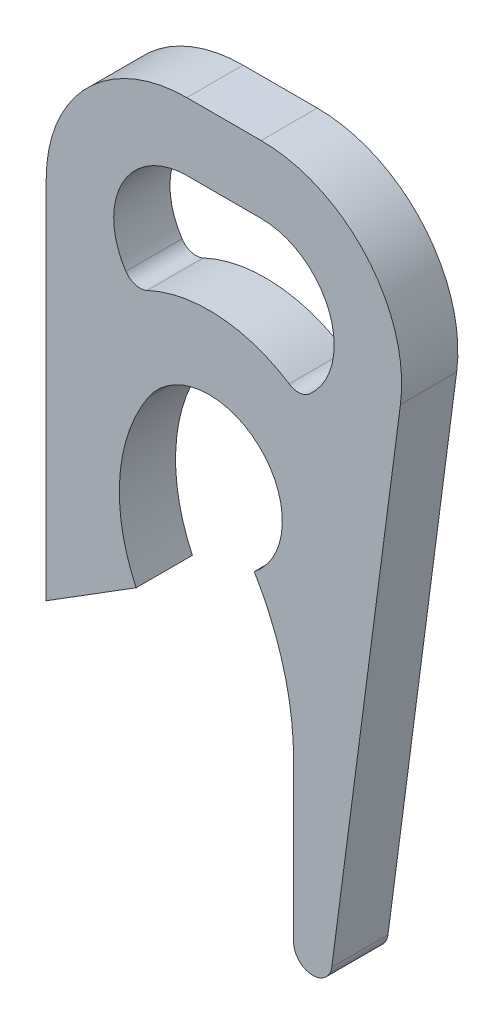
ISO-10303-21;
HEADER;
FILE_DESCRIPTION(('STEP AP214'),'2;1');
FILE_NAME('part.step','',(''),(''),'','','');
FILE_SCHEMA(('AUTOMOTIVE_DESIGN { 1 0 10303 214 1 1 1 1 }'));
ENDSEC;
DATA;
#1=APPLICATION_CONTEXT('core data for automotive mechanical design processes');
#2=APPLICATION_PROTOCOL_DEFINITION('international standard','automotive_design',2000,#1);
#3=PRODUCT_CONTEXT('',#1,'mechanical');
#4=PRODUCT('Part','Part','',(#3));
#5=PRODUCT_RELATED_PRODUCT_CATEGORY('part','',(#4));
#6=PRODUCT_DEFINITION_FORMATION('','',#4);
#7=PRODUCT_DEFINITION_CONTEXT('part definition',#1,'design');
#8=PRODUCT_DEFINITION('design','',#6,#7);
#9=PRODUCT_DEFINITION_SHAPE('','',#8);
#10=(LENGTH_UNIT() NAMED_UNIT(*) SI_UNIT(.MILLI.,.METRE.));
#11=(NAMED_UNIT(*) PLANE_ANGLE_UNIT() SI_UNIT($,.RADIAN.));
#12=(NAMED_UNIT(*) SI_UNIT($,.STERADIAN.) SOLID_ANGLE_UNIT());
#13=UNCERTAINTY_MEASURE_WITH_UNIT(LENGTH_MEASURE(1.E-05),#10,'distance_accuracy_value','');
#14=(GEOMETRIC_REPRESENTATION_CONTEXT(3) GLOBAL_UNCERTAINTY_ASSIGNED_CONTEXT((#13)) GLOBAL_UNIT_ASSIGNED_CONTEXT((#10,
#11,#12)) REPRESENTATION_CONTEXT('',''));
#15=CARTESIAN_POINT('',(0.,0.,0.));
#16=DIRECTION('',(0.,0.,1.));
#17=DIRECTION('',(1.,0.,0.));
#18=AXIS2_PLACEMENT_3D('',#15,#16,#17);
#19=CARTESIAN_POINT('',(8.,5.,5.));
#20=DIRECTION('',(-0.52999894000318,0.847998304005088,0.));
#21=DIRECTION('',(-0.847998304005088,-0.52999894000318,0.));
#22=AXIS2_PLACEMENT_3D('',#19,#20,#21);
#23=PLANE('',#22);
#24=DIRECTION('',(0.847998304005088,0.52999894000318,0.));
#25=VECTOR('',#24,1.);
#26=CARTESIAN_POINT('',(8.,5.,0.));
#27=LINE('',#26,#25);
#28=CARTESIAN_POINT('',(0.,0.,0.));
#29=VERTEX_POINT('',#28);
#30=CARTESIAN_POINT('',(8.,5.,0.));
#31=VERTEX_POINT('',#30);
#32=EDGE_CURVE('E196',#29,#31,#27,.T.);
#33=ORIENTED_EDGE('',*,*,#32,.T.);
#34=DIRECTION('',(0.,0.,-1.));
#35=VECTOR('',#34,1.);
#36=CARTESIAN_POINT('',(8.,5.,5.));
#37=LINE('',#36,#35);
#38=CARTESIAN_POINT('',(8.,5.,5.));
#39=VERTEX_POINT('',#38);
#40=EDGE_CURVE('E11',#39,#31,#37,.T.);
#41=ORIENTED_EDGE('',*,*,#40,.F.);
#42=DIRECTION('',(0.847998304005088,0.52999894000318,0.));
#43=VECTOR('',#42,1.);
#44=CARTESIAN_POINT('',(8.,5.,5.));
#45=LINE('',#44,#43);
#46=CARTESIAN_POINT('',(0.,0.,5.));
#47=VERTEX_POINT('',#46);
#48=EDGE_CURVE('E204',#47,#39,#45,.T.);
#49=ORIENTED_EDGE('',*,*,#48,.F.);
#50=DIRECTION('',(0.,0.,-1.));
#51=VECTOR('',#50,1.);
#52=CARTESIAN_POINT('',(0.,0.,5.));
#53=LINE('',#52,#51);
#54=EDGE_CURVE('E228',#47,#29,#53,.T.);
#55=ORIENTED_EDGE('',*,*,#54,.T.);
#56=EDGE_LOOP('',(#33,#41,#49,#55));
#57=FACE_BOUND('',#56,.T.);
#58=ADVANCED_FACE('F33',(#57),#23,.F.);
#59=CARTESIAN_POINT('',(22.,11.652067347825,5.));
#60=DIRECTION('',(0.,0.,-1.));
#61=DIRECTION('',(-1.,0.,0.));
#62=AXIS2_PLACEMENT_3D('',#59,#60,#61);
#63=CYLINDRICAL_SURFACE('',#62,15.5);
#64=CARTESIAN_POINT('',(22.,11.652067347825,0.));
#65=DIRECTION('',(0.,0.,-1.));
#66=DIRECTION('',(1.,0.,0.));
#67=AXIS2_PLACEMENT_3D('',#64,#65,#66);
#68=CIRCLE('',#67,15.5);
#69=CARTESIAN_POINT('',(9.0749806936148,20.2074093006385,0.));
#70=VERTEX_POINT('',#69);
#71=EDGE_CURVE('E231',#31,#70,#68,.T.);
#72=ORIENTED_EDGE('',*,*,#71,.T.);
#73=DIRECTION('',(0.,0.,-1.));
#74=VECTOR('',#73,1.);
#75=CARTESIAN_POINT('',(9.0749806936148,20.2074093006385,5.));
#76=LINE('',#75,#74);
#77=CARTESIAN_POINT('',(9.0749806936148,20.2074093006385,5.));
#78=VERTEX_POINT('',#77);
#79=EDGE_CURVE('E40',#78,#70,#76,.T.);
#80=ORIENTED_EDGE('',*,*,#79,.F.);
#81=CARTESIAN_POINT('',(22.,11.652067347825,5.));
#82=DIRECTION('',(0.,0.,-1.));
#83=DIRECTION('',(1.,0.,0.));
#84=AXIS2_PLACEMENT_3D('',#81,#82,#83);
#85=CIRCLE('',#84,15.5);
#86=EDGE_CURVE('E207',#39,#78,#85,.T.);
#87=ORIENTED_EDGE('',*,*,#86,.F.);
#88=ORIENTED_EDGE('',*,*,#40,.T.);
#89=EDGE_LOOP('',(#72,#80,#87,#88));
#90=FACE_BOUND('',#89,.T.);
#91=ADVANCED_FACE('F301',(#90),#63,.F.);
#92=CARTESIAN_POINT('',(14.4951500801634,16.6196852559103,5.));
#93=DIRECTION('',(0.,0.,-1.));
#94=DIRECTION('',(-1.,0.,0.));
#95=AXIS2_PLACEMENT_3D('',#92,#93,#94);
#96=CYLINDRICAL_SURFACE('',#95,6.5);
#97=CARTESIAN_POINT('',(14.4951500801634,16.6196852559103,0.));
#98=DIRECTION('',(0.,0.,-1.));
#99=DIRECTION('',(1.,0.,0.));
#100=AXIS2_PLACEMENT_3D('',#97,#98,#99);
#101=CIRCLE('',#100,6.5);
#102=CARTESIAN_POINT('',(18.5,11.5,0.));
#103=VERTEX_POINT('',#102);
#104=EDGE_CURVE('E233',#70,#103,#101,.T.);
#105=ORIENTED_EDGE('',*,*,#104,.T.);
#106=DIRECTION('',(0.,0.,-1.));
#107=VECTOR('',#106,1.);
#108=CARTESIAN_POINT('',(18.5,11.5,5.));
#109=LINE('',#108,#107);
#110=CARTESIAN_POINT('',(18.5,11.5,5.));
#111=VERTEX_POINT('',#110);
#112=EDGE_CURVE('E273',#111,#103,#109,.T.);
#113=ORIENTED_EDGE('',*,*,#112,.F.);
#114=CARTESIAN_POINT('',(14.4951500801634,16.6196852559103,5.));
#115=DIRECTION('',(0.,0.,-1.));
#116=DIRECTION('',(1.,0.,0.));
#117=AXIS2_PLACEMENT_3D('',#114,#115,#116);
#118=CIRCLE('',#117,6.5);
#119=EDGE_CURVE('E210',#78,#111,#118,.T.);
#120=ORIENTED_EDGE('',*,*,#119,.F.);
#121=ORIENTED_EDGE('',*,*,#79,.T.);
#122=EDGE_LOOP('',(#105,#113,#120,#121));
#123=FACE_BOUND('',#122,.T.);
#124=ADVANCED_FACE('F280',(#123),#96,.F.);
#125=CARTESIAN_POINT('',(-3.,-1.25735082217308,5.));
#126=DIRECTION('',(0.,0.,-1.));
#127=DIRECTION('',(-1.,0.,0.));
#128=AXIS2_PLACEMENT_3D('',#125,#126,#127);
#129=CYLINDRICAL_SURFACE('',#128,25.);
#130=CARTESIAN_POINT('',(-3.,-1.25735082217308,0.));
#131=DIRECTION('',(0.,0.,-1.));
#132=DIRECTION('',(1.,0.,0.));
#133=AXIS2_PLACEMENT_3D('',#130,#131,#132);
#134=CIRCLE('',#133,25.);
#135=CARTESIAN_POINT('',(22.,-1.25735082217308,0.));
#136=VERTEX_POINT('',#135);
#137=EDGE_CURVE('E235',#103,#136,#134,.T.);
#138=ORIENTED_EDGE('',*,*,#137,.T.);
#139=DIRECTION('',(0.,0.,-1.));
#140=VECTOR('',#139,1.);
#141=CARTESIAN_POINT('',(22.,-1.25735082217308,5.));
#142=LINE('',#141,#140);
#143=CARTESIAN_POINT('',(22.,-1.25735082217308,5.));
#144=VERTEX_POINT('',#143);
#145=EDGE_CURVE('E270',#144,#136,#142,.T.);
#146=ORIENTED_EDGE('',*,*,#145,.F.);
#147=CARTESIAN_POINT('',(-3.,-1.25735082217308,5.));
#148=DIRECTION('',(0.,0.,-1.));
#149=DIRECTION('',(1.,0.,0.));
#150=AXIS2_PLACEMENT_3D('',#147,#148,#149);
#151=CIRCLE('',#150,25.);
#152=EDGE_CURVE('E212',#111,#144,#151,.T.);
#153=ORIENTED_EDGE('',*,*,#152,.F.);
#154=ORIENTED_EDGE('',*,*,#112,.T.);
#155=EDGE_LOOP('',(#138,#146,#153,#154));
#156=FACE_BOUND('',#155,.T.);
#157=ADVANCED_FACE('F289',(#156),#129,.F.);
#158=CARTESIAN_POINT('',(22.,-15.2961946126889,5.));
#159=DIRECTION('',(1.,0.,0.));
#160=DIRECTION('',(0.,0.,-1.));
#161=AXIS2_PLACEMENT_3D('',#158,#159,#160);
#162=PLANE('',#161);
#163=DIRECTION('',(0.,-1.,0.));
#164=VECTOR('',#163,1.);
#165=CARTESIAN_POINT('',(22.,-15.2961946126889,0.));
#166=LINE('',#165,#164);
#167=CARTESIAN_POINT('',(22.,-15.2961946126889,0.));
#168=VERTEX_POINT('',#167);
#169=EDGE_CURVE('E237',#136,#168,#166,.T.);
#170=ORIENTED_EDGE('',*,*,#169,.T.);
#171=DIRECTION('',(0.,0.,-1.));
#172=VECTOR('',#171,1.);
#173=CARTESIAN_POINT('',(22.,-15.2961946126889,5.));
#174=LINE('',#173,#172);
#175=CARTESIAN_POINT('',(22.,-15.2961946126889,5.));
#176=VERTEX_POINT('',#175);
#177=EDGE_CURVE('E267',#176,#168,#174,.T.);
#178=ORIENTED_EDGE('',*,*,#177,.F.);
#179=DIRECTION('',(0.,-1.,0.));
#180=VECTOR('',#179,1.);
#181=CARTESIAN_POINT('',(22.,-15.2961946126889,5.));
#182=LINE('',#181,#180);
#183=EDGE_CURVE('E214',#144,#176,#182,.T.);
#184=ORIENTED_EDGE('',*,*,#183,.F.);
#185=ORIENTED_EDGE('',*,*,#145,.T.);
#186=EDGE_LOOP('',(#170,#178,#184,#185));
#187=FACE_BOUND('',#186,.T.);
#188=ADVANCED_FACE('F293',(#187),#162,.F.);
#189=CARTESIAN_POINT('',(23.7038053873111,-15.2961946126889,5.));
#190=DIRECTION('',(0.,0.,-1.));
#191=DIRECTION('',(-1.,0.,0.));
#192=AXIS2_PLACEMENT_3D('',#189,#190,#191);
#193=CYLINDRICAL_SURFACE('',#192,1.70380538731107);
#194=CARTESIAN_POINT('',(23.7038053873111,-15.2961946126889,0.));
#195=DIRECTION('',(0.,0.,1.));
#196=DIRECTION('',(1.,0.,0.));
#197=AXIS2_PLACEMENT_3D('',#194,#195,#196);
#198=CIRCLE('',#197,1.70380538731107);
#199=CARTESIAN_POINT('',(25.3930344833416,-15.5185858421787,0.));
#200=VERTEX_POINT('',#199);
#201=EDGE_CURVE('E239',#168,#200,#198,.T.);
#202=ORIENTED_EDGE('',*,*,#201,.T.);
#203=DIRECTION('',(0.,0.,-1.));
#204=VECTOR('',#203,1.);
#205=CARTESIAN_POINT('',(25.3930344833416,-15.5185858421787,5.));
#206=LINE('',#205,#204);
#207=CARTESIAN_POINT('',(25.3930344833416,-15.5185858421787,5.));
#208=VERTEX_POINT('',#207);
#209=EDGE_CURVE('E264',#208,#200,#206,.T.);
#210=ORIENTED_EDGE('',*,*,#209,.F.);
#211=CARTESIAN_POINT('',(23.7038053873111,-15.2961946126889,5.));
#212=DIRECTION('',(0.,0.,1.));
#213=DIRECTION('',(1.,0.,0.));
#214=AXIS2_PLACEMENT_3D('',#211,#212,#213);
#215=CIRCLE('',#214,1.70380538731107);
#216=EDGE_CURVE('E216',#176,#208,#215,.T.);
#217=ORIENTED_EDGE('',*,*,#216,.F.);
#218=ORIENTED_EDGE('',*,*,#177,.T.);
#219=EDGE_LOOP('',(#202,#210,#217,#218));
#220=FACE_BOUND('',#219,.T.);
#221=ADVANCED_FACE('F329',(#220),#193,.T.);
#222=CARTESIAN_POINT('',(31.5,30.8684225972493,5.));
#223=DIRECTION('',(-0.99144486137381,0.130526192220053,0.));
#224=DIRECTION('',(-0.130526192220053,-0.99144486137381,0.));
#225=AXIS2_PLACEMENT_3D('',#222,#223,#224);
#226=PLANE('',#225);
#227=DIRECTION('',(0.130526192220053,0.99144486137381,0.));
#228=VECTOR('',#227,1.);
#229=CARTESIAN_POINT('',(31.5,30.8684225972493,0.));
#230=LINE('',#229,#228);
#231=CARTESIAN_POINT('',(31.5,30.8684225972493,0.));
#232=VERTEX_POINT('',#231);
#233=EDGE_CURVE('E241',#200,#232,#230,.T.);
#234=ORIENTED_EDGE('',*,*,#233,.T.);
#235=DIRECTION('',(0.,0.,-1.));
#236=VECTOR('',#235,1.);
#237=CARTESIAN_POINT('',(31.5,30.8684225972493,5.));
#238=LINE('',#237,#236);
#239=CARTESIAN_POINT('',(31.5,30.8684225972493,5.));
#240=VERTEX_POINT('',#239);
#241=EDGE_CURVE('E261',#240,#232,#238,.T.);
#242=ORIENTED_EDGE('',*,*,#241,.F.);
#243=DIRECTION('',(0.130526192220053,0.99144486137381,0.));
#244=VECTOR('',#243,1.);
#245=CARTESIAN_POINT('',(31.5,30.8684225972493,5.));
#246=LINE('',#245,#244);
#247=EDGE_CURVE('E218',#208,#240,#246,.T.);
#248=ORIENTED_EDGE('',*,*,#247,.F.);
#249=ORIENTED_EDGE('',*,*,#209,.T.);
#250=EDGE_LOOP('',(#234,#242,#248,#249));
#251=FACE_BOUND('',#250,.T.);
#252=ADVANCED_FACE('F327',(#251),#226,.F.);
#253=CARTESIAN_POINT('',(19.1069392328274,32.5,5.));
#254=DIRECTION('',(0.,0.,-1.));
#255=DIRECTION('',(-1.,0.,0.));
#256=AXIS2_PLACEMENT_3D('',#253,#254,#255);
#257=CYLINDRICAL_SURFACE('',#256,12.5);
#258=CARTESIAN_POINT('',(19.1069392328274,32.5,0.));
#259=DIRECTION('',(0.,0.,1.));
#260=DIRECTION('',(-1.,0.,0.));
#261=AXIS2_PLACEMENT_3D('',#258,#259,#260);
#262=CIRCLE('',#261,12.5);
#263=CARTESIAN_POINT('',(19.1069392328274,45.,0.));
#264=VERTEX_POINT('',#263);
#265=EDGE_CURVE('E243',#232,#264,#262,.T.);
#266=ORIENTED_EDGE('',*,*,#265,.T.);
#267=DIRECTION('',(0.,0.,-1.));
#268=VECTOR('',#267,1.);
#269=CARTESIAN_POINT('',(19.1069392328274,45.,5.));
#270=LINE('',#269,#268);
#271=CARTESIAN_POINT('',(19.1069392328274,45.,5.));
#272=VERTEX_POINT('',#271);
#273=EDGE_CURVE('E258',#272,#264,#270,.T.);
#274=ORIENTED_EDGE('',*,*,#273,.F.);
#275=CARTESIAN_POINT('',(19.1069392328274,32.5,5.));
#276=DIRECTION('',(0.,0.,1.));
#277=DIRECTION('',(-1.,0.,0.));
#278=AXIS2_PLACEMENT_3D('',#275,#276,#277);
#279=CIRCLE('',#278,12.5);
#280=EDGE_CURVE('E220',#240,#272,#279,.T.);
#281=ORIENTED_EDGE('',*,*,#280,.F.);
#282=ORIENTED_EDGE('',*,*,#241,.T.);
#283=EDGE_LOOP('',(#266,#274,#281,#282));
#284=FACE_BOUND('',#283,.T.);
#285=ADVANCED_FACE('F322',(#284),#257,.T.);
#286=CARTESIAN_POINT('',(12.5,45.,5.));
#287=DIRECTION('',(0.,-1.,0.));
#288=DIRECTION('',(1.,0.,0.));
#289=AXIS2_PLACEMENT_3D('',#286,#287,#288);
#290=PLANE('',#289);
#291=DIRECTION('',(-1.,0.,0.));
#292=VECTOR('',#291,1.);
#293=CARTESIAN_POINT('',(12.5,45.,0.));
#294=LINE('',#293,#292);
#295=CARTESIAN_POINT('',(12.5,45.,0.));
#296=VERTEX_POINT('',#295);
#297=EDGE_CURVE('E245',#264,#296,#294,.T.);
#298=ORIENTED_EDGE('',*,*,#297,.T.);
#299=DIRECTION('',(0.,0.,-1.));
#300=VECTOR('',#299,1.);
#301=CARTESIAN_POINT('',(12.5,45.,5.));
#302=LINE('',#301,#300);
#303=CARTESIAN_POINT('',(12.5,45.,5.));
#304=VERTEX_POINT('',#303);
#305=EDGE_CURVE('E255',#304,#296,#302,.T.);
#306=ORIENTED_EDGE('',*,*,#305,.F.);
#307=DIRECTION('',(-1.,0.,0.));
#308=VECTOR('',#307,1.);
#309=CARTESIAN_POINT('',(12.5,45.,5.));
#310=LINE('',#309,#308);
#311=EDGE_CURVE('E222',#272,#304,#310,.T.);
#312=ORIENTED_EDGE('',*,*,#311,.F.);
#313=ORIENTED_EDGE('',*,*,#273,.T.);
#314=EDGE_LOOP('',(#298,#306,#312,#313));
#315=FACE_BOUND('',#314,.T.);
#316=ADVANCED_FACE('F317',(#315),#290,.F.);
#317=CARTESIAN_POINT('',(12.5,32.5,5.));
#318=DIRECTION('',(0.,0.,-1.));
#319=DIRECTION('',(-1.,0.,0.));
#320=AXIS2_PLACEMENT_3D('',#317,#318,#319);
#321=CYLINDRICAL_SURFACE('',#320,12.5);
#322=CARTESIAN_POINT('',(12.5,32.5,0.));
#323=DIRECTION('',(0.,0.,1.));
#324=DIRECTION('',(-1.,0.,0.));
#325=AXIS2_PLACEMENT_3D('',#322,#323,#324);
#326=CIRCLE('',#325,12.5);
#327=CARTESIAN_POINT('',(0.,32.5,0.));
#328=VERTEX_POINT('',#327);
#329=EDGE_CURVE('E247',#296,#328,#326,.T.);
#330=ORIENTED_EDGE('',*,*,#329,.T.);
#331=DIRECTION('',(0.,0.,-1.));
#332=VECTOR('',#331,1.);
#333=CARTESIAN_POINT('',(0.,32.5,5.));
#334=LINE('',#333,#332);
#335=CARTESIAN_POINT('',(0.,32.5,5.));
#336=VERTEX_POINT('',#335);
#337=EDGE_CURVE('E252',#336,#328,#334,.T.);
#338=ORIENTED_EDGE('',*,*,#337,.F.);
#339=CARTESIAN_POINT('',(12.5,32.5,5.));
#340=DIRECTION('',(0.,0.,1.));
#341=DIRECTION('',(-1.,0.,0.));
#342=AXIS2_PLACEMENT_3D('',#339,#340,#341);
#343=CIRCLE('',#342,12.5);
#344=EDGE_CURVE('E224',#304,#336,#343,.T.);
#345=ORIENTED_EDGE('',*,*,#344,.F.);
#346=ORIENTED_EDGE('',*,*,#305,.T.);
#347=EDGE_LOOP('',(#330,#338,#345,#346));
#348=FACE_BOUND('',#347,.T.);
#349=ADVANCED_FACE('F313',(#348),#321,.T.);
#350=CARTESIAN_POINT('',(0.,0.,5.));
#351=DIRECTION('',(1.,0.,0.));
#352=DIRECTION('',(0.,0.,-1.));
#353=AXIS2_PLACEMENT_3D('',#350,#351,#352);
#354=PLANE('',#353);
#355=DIRECTION('',(0.,-1.,0.));
#356=VECTOR('',#355,1.);
#357=CARTESIAN_POINT('',(0.,0.,0.));
#358=LINE('',#357,#356);
#359=EDGE_CURVE('E208',#328,#29,#358,.T.);
#360=ORIENTED_EDGE('',*,*,#359,.T.);
#361=ORIENTED_EDGE('',*,*,#54,.F.);
#362=DIRECTION('',(0.,-1.,0.));
#363=VECTOR('',#362,1.);
#364=CARTESIAN_POINT('',(0.,0.,5.));
#365=LINE('',#364,#363);
#366=EDGE_CURVE('E226',#336,#47,#365,.T.);
#367=ORIENTED_EDGE('',*,*,#366,.F.);
#368=ORIENTED_EDGE('',*,*,#337,.T.);
#369=EDGE_LOOP('',(#360,#361,#367,#368));
#370=FACE_BOUND('',#369,.T.);
#371=ADVANCED_FACE('F308',(#370),#354,.F.);
#372=CARTESIAN_POINT('',(12.5,32.5,5.));
#373=DIRECTION('',(0.,0.,-1.));
#374=DIRECTION('',(-1.,0.,0.));
#375=AXIS2_PLACEMENT_3D('',#372,#373,#374);
#376=PLANE('',#375);
#377=CARTESIAN_POINT('',(8.32870518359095,29.7431359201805,5.));
#378=DIRECTION('',(0.,0.,1.));
#379=DIRECTION('',(-1.,0.,0.));
#380=AXIS2_PLACEMENT_3D('',#377,#378,#379);
#381=CIRCLE('',#380,1.5);
#382=CARTESIAN_POINT('',(7.07731673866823,28.9160766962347,5.));
#383=VERTEX_POINT('',#382);
#384=CARTESIAN_POINT('',(8.96661327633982,28.3855375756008,5.));
#385=VERTEX_POINT('',#384);
#386=EDGE_CURVE('E184',#383,#385,#381,.T.);
#387=ORIENTED_EDGE('',*,*,#386,.F.);
#388=CARTESIAN_POINT('',(12.5,32.5,5.));
#389=DIRECTION('',(0.,0.,1.));
#390=DIRECTION('',(-1.,0.,0.));
#391=AXIS2_PLACEMENT_3D('',#388,#389,#390);
#392=CIRCLE('',#391,6.5);
#393=CARTESIAN_POINT('',(12.5,39.,5.));
#394=VERTEX_POINT('',#393);
#395=EDGE_CURVE('E47',#394,#383,#392,.T.);
#396=ORIENTED_EDGE('',*,*,#395,.F.);
#397=DIRECTION('',(-1.,0.,0.));
#398=VECTOR('',#397,1.);
#399=CARTESIAN_POINT('',(12.5,39.,5.));
#400=LINE('',#399,#398);
#401=CARTESIAN_POINT('',(19.1069392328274,39.,5.));
#402=VERTEX_POINT('',#401);
#403=EDGE_CURVE('E170',#402,#394,#400,.T.);
#404=ORIENTED_EDGE('',*,*,#403,.F.);
#405=CARTESIAN_POINT('',(19.1069392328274,32.5,5.));
#406=DIRECTION('',(0.,0.,1.));
#407=DIRECTION('',(1.,0.,0.));
#408=AXIS2_PLACEMENT_3D('',#405,#406,#407);
#409=CIRCLE('',#408,6.5);
#410=CARTESIAN_POINT('',(23.4200553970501,27.6371789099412,5.));
#411=VERTEX_POINT('',#410);
#412=EDGE_CURVE('E173',#411,#402,#409,.T.);
#413=ORIENTED_EDGE('',*,*,#412,.F.);
#414=CARTESIAN_POINT('',(22.4247208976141,28.7593683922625,5.));
#415=DIRECTION('',(0.,0.,1.));
#416=DIRECTION('',(1.,0.,0.));
#417=AXIS2_PLACEMENT_3D('',#414,#415,#416);
#418=CIRCLE('',#417,1.5);
#419=CARTESIAN_POINT('',(21.6044204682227,27.503539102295,5.));
#420=VERTEX_POINT('',#419);
#421=EDGE_CURVE('E189',#420,#411,#418,.T.);
#422=ORIENTED_EDGE('',*,*,#421,.F.);
#423=CARTESIAN_POINT('',(14.4951500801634,16.6196852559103,5.));
#424=DIRECTION('',(0.,0.,-1.));
#425=DIRECTION('',(-1.,0.,0.));
#426=AXIS2_PLACEMENT_3D('',#423,#424,#425);
#427=CIRCLE('',#426,13.);
#428=EDGE_CURVE('E186',#385,#420,#427,.T.);
#429=ORIENTED_EDGE('',*,*,#428,.F.);
#430=EDGE_LOOP('',(#387,#396,#404,#413,#422,#429));
#431=FACE_BOUND('',#430,.T.);
#432=ORIENTED_EDGE('',*,*,#48,.T.);
#433=ORIENTED_EDGE('',*,*,#86,.T.);
#434=ORIENTED_EDGE('',*,*,#119,.T.);
#435=ORIENTED_EDGE('',*,*,#152,.T.);
#436=ORIENTED_EDGE('',*,*,#183,.T.);
#437=ORIENTED_EDGE('',*,*,#216,.T.);
#438=ORIENTED_EDGE('',*,*,#247,.T.);
#439=ORIENTED_EDGE('',*,*,#280,.T.);
#440=ORIENTED_EDGE('',*,*,#311,.T.);
#441=ORIENTED_EDGE('',*,*,#344,.T.);
#442=ORIENTED_EDGE('',*,*,#366,.T.);
#443=EDGE_LOOP('',(#432,#433,#434,#435,#436,#437,#438,#439,#440,#441,#442));
#444=FACE_BOUND('',#443,.T.);
#445=ADVANCED_FACE('F297',(#431,#444),#376,.F.);
#446=CARTESIAN_POINT('',(12.5,32.5,0.));
#447=DIRECTION('',(0.,0.,-1.));
#448=DIRECTION('',(-1.,0.,0.));
#449=AXIS2_PLACEMENT_3D('',#446,#447,#448);
#450=PLANE('',#449);
#451=CARTESIAN_POINT('',(12.5,32.5,0.));
#452=DIRECTION('',(0.,0.,1.));
#453=DIRECTION('',(-1.,0.,0.));
#454=AXIS2_PLACEMENT_3D('',#451,#452,#453);
#455=CIRCLE('',#454,6.5);
#456=CARTESIAN_POINT('',(12.5,39.,0.));
#457=VERTEX_POINT('',#456);
#458=CARTESIAN_POINT('',(7.07731673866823,28.9160766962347,0.));
#459=VERTEX_POINT('',#458);
#460=EDGE_CURVE('E153',#457,#459,#455,.T.);
#461=ORIENTED_EDGE('',*,*,#460,.T.);
#462=CARTESIAN_POINT('',(8.32870518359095,29.7431359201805,0.));
#463=DIRECTION('',(0.,0.,1.));
#464=DIRECTION('',(-1.,0.,0.));
#465=AXIS2_PLACEMENT_3D('',#462,#463,#464);
#466=CIRCLE('',#465,1.5);
#467=CARTESIAN_POINT('',(8.96661327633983,28.3855375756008,0.));
#468=VERTEX_POINT('',#467);
#469=EDGE_CURVE('E162',#459,#468,#466,.T.);
#470=ORIENTED_EDGE('',*,*,#469,.T.);
#471=CARTESIAN_POINT('',(14.4951500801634,16.6196852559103,0.));
#472=DIRECTION('',(0.,0.,-1.));
#473=DIRECTION('',(-1.,0.,0.));
#474=AXIS2_PLACEMENT_3D('',#471,#472,#473);
#475=CIRCLE('',#474,13.);
#476=CARTESIAN_POINT('',(21.6044204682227,27.503539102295,0.));
#477=VERTEX_POINT('',#476);
#478=EDGE_CURVE('E55',#468,#477,#475,.T.);
#479=ORIENTED_EDGE('',*,*,#478,.T.);
#480=CARTESIAN_POINT('',(22.4247208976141,28.7593683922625,0.));
#481=DIRECTION('',(0.,0.,1.));
#482=DIRECTION('',(1.,0.,0.));
#483=AXIS2_PLACEMENT_3D('',#480,#481,#482);
#484=CIRCLE('',#483,1.5);
#485=CARTESIAN_POINT('',(23.4200553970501,27.6371789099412,0.));
#486=VERTEX_POINT('',#485);
#487=EDGE_CURVE('E177',#477,#486,#484,.T.);
#488=ORIENTED_EDGE('',*,*,#487,.T.);
#489=CARTESIAN_POINT('',(19.1069392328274,32.5,0.));
#490=DIRECTION('',(0.,0.,1.));
#491=DIRECTION('',(1.,0.,0.));
#492=AXIS2_PLACEMENT_3D('',#489,#490,#491);
#493=CIRCLE('',#492,6.5);
#494=CARTESIAN_POINT('',(19.1069392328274,39.,0.));
#495=VERTEX_POINT('',#494);
#496=EDGE_CURVE('E180',#486,#495,#493,.T.);
#497=ORIENTED_EDGE('',*,*,#496,.T.);
#498=DIRECTION('',(-1.,0.,0.));
#499=VECTOR('',#498,1.);
#500=CARTESIAN_POINT('',(12.5,39.,0.));
#501=LINE('',#500,#499);
#502=EDGE_CURVE('E159',#495,#457,#501,.T.);
#503=ORIENTED_EDGE('',*,*,#502,.T.);
#504=EDGE_LOOP('',(#461,#470,#479,#488,#497,#503));
#505=FACE_BOUND('',#504,.T.);
#506=ORIENTED_EDGE('',*,*,#32,.F.);
#507=ORIENTED_EDGE('',*,*,#359,.F.);
#508=ORIENTED_EDGE('',*,*,#329,.F.);
#509=ORIENTED_EDGE('',*,*,#297,.F.);
#510=ORIENTED_EDGE('',*,*,#265,.F.);
#511=ORIENTED_EDGE('',*,*,#233,.F.);
#512=ORIENTED_EDGE('',*,*,#201,.F.);
#513=ORIENTED_EDGE('',*,*,#169,.F.);
#514=ORIENTED_EDGE('',*,*,#137,.F.);
#515=ORIENTED_EDGE('',*,*,#104,.F.);
#516=ORIENTED_EDGE('',*,*,#71,.F.);
#517=EDGE_LOOP('',(#506,#507,#508,#509,#510,#511,#512,#513,#514,#515,#516));
#518=FACE_BOUND('',#517,.T.);
#519=ADVANCED_FACE('F166',(#505,#518),#450,.T.);
#520=CARTESIAN_POINT('',(12.5,32.5,0.));
#521=DIRECTION('',(0.,0.,1.));
#522=DIRECTION('',(1.,0.,0.));
#523=AXIS2_PLACEMENT_3D('',#520,#521,#522);
#524=CYLINDRICAL_SURFACE('',#523,6.5);
#525=ORIENTED_EDGE('',*,*,#395,.T.);
#526=DIRECTION('',(0.,0.,1.));
#527=VECTOR('',#526,1.);
#528=CARTESIAN_POINT('',(7.07731673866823,28.9160766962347,0.));
#529=LINE('',#528,#527);
#530=EDGE_CURVE('E149',#459,#383,#529,.T.);
#531=ORIENTED_EDGE('',*,*,#530,.F.);
#532=ORIENTED_EDGE('',*,*,#460,.F.);
#533=DIRECTION('',(0.,0.,1.));
#534=VECTOR('',#533,1.);
#535=CARTESIAN_POINT('',(12.5,39.,0.));
#536=LINE('',#535,#534);
#537=EDGE_CURVE('E194',#457,#394,#536,.T.);
#538=ORIENTED_EDGE('',*,*,#537,.T.);
#539=EDGE_LOOP('',(#525,#531,#532,#538));
#540=FACE_BOUND('',#539,.T.);
#541=ADVANCED_FACE('F151',(#540),#524,.F.);
#542=CARTESIAN_POINT('',(12.5,39.,0.));
#543=DIRECTION('',(0.,1.,0.));
#544=DIRECTION('',(0.,0.,1.));
#545=AXIS2_PLACEMENT_3D('',#542,#543,#544);
#546=PLANE('',#545);
#547=ORIENTED_EDGE('',*,*,#403,.T.);
#548=ORIENTED_EDGE('',*,*,#537,.F.);
#549=ORIENTED_EDGE('',*,*,#502,.F.);
#550=DIRECTION('',(0.,0.,1.));
#551=VECTOR('',#550,1.);
#552=CARTESIAN_POINT('',(19.1069392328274,39.,0.));
#553=LINE('',#552,#551);
#554=EDGE_CURVE('E197',#495,#402,#553,.T.);
#555=ORIENTED_EDGE('',*,*,#554,.T.);
#556=EDGE_LOOP('',(#547,#548,#549,#555));
#557=FACE_BOUND('',#556,.T.);
#558=ADVANCED_FACE('F424',(#557),#546,.F.);
#559=CARTESIAN_POINT('',(19.1069392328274,32.5,0.));
#560=DIRECTION('',(0.,0.,1.));
#561=DIRECTION('',(1.,0.,0.));
#562=AXIS2_PLACEMENT_3D('',#559,#560,#561);
#563=CYLINDRICAL_SURFACE('',#562,6.5);
#564=ORIENTED_EDGE('',*,*,#412,.T.);
#565=ORIENTED_EDGE('',*,*,#554,.F.);
#566=ORIENTED_EDGE('',*,*,#496,.F.);
#567=DIRECTION('',(0.,0.,1.));
#568=VECTOR('',#567,1.);
#569=CARTESIAN_POINT('',(23.4200553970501,27.6371789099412,0.));
#570=LINE('',#569,#568);
#571=EDGE_CURVE('E199',#486,#411,#570,.T.);
#572=ORIENTED_EDGE('',*,*,#571,.T.);
#573=EDGE_LOOP('',(#564,#565,#566,#572));
#574=FACE_BOUND('',#573,.T.);
#575=ADVANCED_FACE('F433',(#574),#563,.F.);
#576=CARTESIAN_POINT('',(22.4247208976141,28.7593683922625,0.));
#577=DIRECTION('',(0.,0.,1.));
#578=DIRECTION('',(1.,0.,0.));
#579=AXIS2_PLACEMENT_3D('',#576,#577,#578);
#580=CYLINDRICAL_SURFACE('',#579,1.5);
#581=ORIENTED_EDGE('',*,*,#421,.T.);
#582=ORIENTED_EDGE('',*,*,#571,.F.);
#583=ORIENTED_EDGE('',*,*,#487,.F.);
#584=DIRECTION('',(0.,0.,1.));
#585=VECTOR('',#584,1.);
#586=CARTESIAN_POINT('',(21.6044204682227,27.503539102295,0.));
#587=LINE('',#586,#585);
#588=EDGE_CURVE('E201',#477,#420,#587,.T.);
#589=ORIENTED_EDGE('',*,*,#588,.T.);
#590=EDGE_LOOP('',(#581,#582,#583,#589));
#591=FACE_BOUND('',#590,.T.);
#592=ADVANCED_FACE('F443',(#591),#580,.F.);
#593=CARTESIAN_POINT('',(14.4951500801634,16.6196852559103,0.));
#594=DIRECTION('',(0.,0.,1.));
#595=DIRECTION('',(1.,0.,0.));
#596=AXIS2_PLACEMENT_3D('',#593,#594,#595);
#597=CYLINDRICAL_SURFACE('',#596,13.);
#598=ORIENTED_EDGE('',*,*,#428,.T.);
#599=ORIENTED_EDGE('',*,*,#588,.F.);
#600=ORIENTED_EDGE('',*,*,#478,.F.);
#601=DIRECTION('',(0.,0.,1.));
#602=VECTOR('',#601,1.);
#603=CARTESIAN_POINT('',(8.96661327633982,28.3855375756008,0.));
#604=LINE('',#603,#602);
#605=EDGE_CURVE('E158',#468,#385,#604,.T.);
#606=ORIENTED_EDGE('',*,*,#605,.T.);
#607=EDGE_LOOP('',(#598,#599,#600,#606));
#608=FACE_BOUND('',#607,.T.);
#609=ADVANCED_FACE('F453',(#608),#597,.T.);
#610=CARTESIAN_POINT('',(8.32870518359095,29.7431359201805,0.));
#611=DIRECTION('',(0.,0.,1.));
#612=DIRECTION('',(1.,0.,0.));
#613=AXIS2_PLACEMENT_3D('',#610,#611,#612);
#614=CYLINDRICAL_SURFACE('',#613,1.5);
#615=ORIENTED_EDGE('',*,*,#386,.T.);
#616=ORIENTED_EDGE('',*,*,#605,.F.);
#617=ORIENTED_EDGE('',*,*,#469,.F.);
#618=ORIENTED_EDGE('',*,*,#530,.T.);
#619=EDGE_LOOP('',(#615,#616,#617,#618));
#620=FACE_BOUND('',#619,.T.);
#621=ADVANCED_FACE('F163',(#620),#614,.F.);
#622=CLOSED_SHELL('',(#58,#91,#124,#157,#188,#221,#252,#285,#316,#349,#371,#445,#519,#541,#558,
#575,#592,#609,#621));
#623=MANIFOLD_SOLID_BREP('B2',#622);
#624=ADVANCED_BREP_SHAPE_REPRESENTATION('',(#18,#623),#14);
#625=SHAPE_DEFINITION_REPRESENTATION(#9,#624);
ENDSEC;
END-ISO-10303-21;
